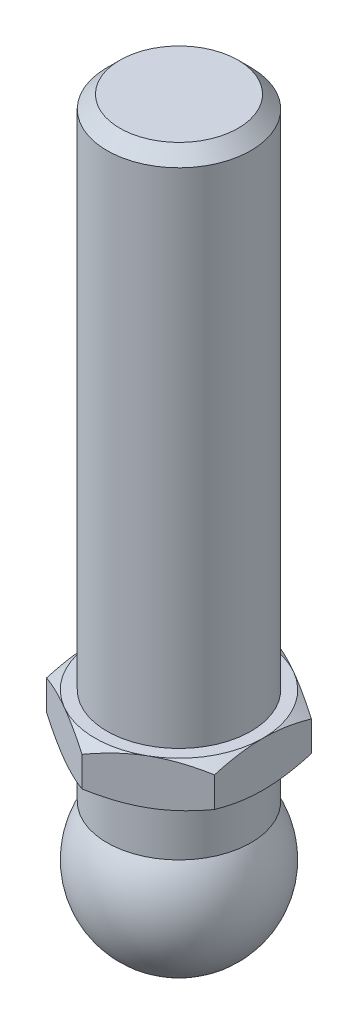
ISO-10303-21;
HEADER;
FILE_DESCRIPTION(('STEP AP214'),'2;1');
FILE_NAME('part.step','',(''),(''),'','','');
FILE_SCHEMA(('AUTOMOTIVE_DESIGN { 1 0 10303 214 1 1 1 1 }'));
ENDSEC;
DATA;
#1=APPLICATION_CONTEXT('core data for automotive mechanical design processes');
#2=APPLICATION_PROTOCOL_DEFINITION('international standard','automotive_design',2000,#1);
#3=PRODUCT_CONTEXT('',#1,'mechanical');
#4=PRODUCT('Part','Part','',(#3));
#5=PRODUCT_RELATED_PRODUCT_CATEGORY('part','',(#4));
#6=PRODUCT_DEFINITION_FORMATION('','',#4);
#7=PRODUCT_DEFINITION_CONTEXT('part definition',#1,'design');
#8=PRODUCT_DEFINITION('design','',#6,#7);
#9=PRODUCT_DEFINITION_SHAPE('','',#8);
#10=(LENGTH_UNIT() NAMED_UNIT(*) SI_UNIT(.MILLI.,.METRE.));
#11=(NAMED_UNIT(*) PLANE_ANGLE_UNIT() SI_UNIT($,.RADIAN.));
#12=(NAMED_UNIT(*) SI_UNIT($,.STERADIAN.) SOLID_ANGLE_UNIT());
#13=UNCERTAINTY_MEASURE_WITH_UNIT(LENGTH_MEASURE(1.E-05),#10,'distance_accuracy_value','');
#14=(GEOMETRIC_REPRESENTATION_CONTEXT(3) GLOBAL_UNCERTAINTY_ASSIGNED_CONTEXT((#13)) GLOBAL_UNIT_ASSIGNED_CONTEXT((#10,
#11,#12)) REPRESENTATION_CONTEXT('',''));
#15=CARTESIAN_POINT('',(0.,0.,0.));
#16=DIRECTION('',(0.,0.,1.));
#17=DIRECTION('',(1.,0.,0.));
#18=AXIS2_PLACEMENT_3D('',#15,#16,#17);
#19=CARTESIAN_POINT('',(0.,12.25,0.));
#20=DIRECTION('',(0.,-1.,0.));
#21=DIRECTION('',(0.,0.,-1.));
#22=AXIS2_PLACEMENT_3D('',#19,#20,#21);
#23=CONICAL_SURFACE('',#22,7.,1.0471975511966);
#24=CARTESIAN_POINT('',(-7.,8.18828268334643,12.1648696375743));
#25=CARTESIAN_POINT('',(-7.,8.33391573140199,11.8738003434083));
#26=CARTESIAN_POINT('',(-7.,8.47854589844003,11.5822239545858));
#27=CARTESIAN_POINT('',(-7.,8.76531569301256,10.997825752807));
#28=CARTESIAN_POINT('',(-7.,8.90745515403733,10.7050038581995));
#29=CARTESIAN_POINT('',(-7.,9.18902214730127,10.117331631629));
#30=CARTESIAN_POINT('',(-7.,9.32844364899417,9.8224784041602));
#31=CARTESIAN_POINT('',(-7.,9.60360604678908,9.23106328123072));
#32=CARTESIAN_POINT('',(-7.,9.73934701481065,8.93450141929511));
#33=CARTESIAN_POINT('',(-7.,10.0123110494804,8.32593520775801));
#34=CARTESIAN_POINT('',(-7.,10.1493254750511,8.0138369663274));
#35=CARTESIAN_POINT('',(-7.,10.4171383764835,7.38695797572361));
#36=CARTESIAN_POINT('',(-7.,10.5479365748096,7.07217710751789));
#37=CARTESIAN_POINT('',(-7.,10.8015530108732,6.43962449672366));
#38=CARTESIAN_POINT('',(-7.,10.924376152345,6.12185473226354));
#39=CARTESIAN_POINT('',(-7.,11.1599016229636,5.4826031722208));
#40=CARTESIAN_POINT('',(-7.,11.2726050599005,5.16112178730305));
#41=CARTESIAN_POINT('',(-7.,11.5099014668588,4.43821731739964));
#42=CARTESIAN_POINT('',(-7.,11.631118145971,4.03566892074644));
#43=CARTESIAN_POINT('',(-7.,11.8469740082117,3.22331060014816));
#44=CARTESIAN_POINT('',(-7.,11.9416155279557,2.81350131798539));
#45=CARTESIAN_POINT('',(-7.,12.0569999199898,2.1974256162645));
#46=CARTESIAN_POINT('',(-7.,12.0908518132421,1.99359214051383));
#47=CARTESIAN_POINT('',(-7.,12.1493191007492,1.58461613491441));
#48=CARTESIAN_POINT('',(-7.,12.1739358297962,1.37947379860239));
#49=CARTESIAN_POINT('',(-7.,12.2131968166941,0.968289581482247));
#50=CARTESIAN_POINT('',(-7.,12.2278439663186,0.762247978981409));
#51=CARTESIAN_POINT('',(-7.,12.2467021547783,0.349683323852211));
#52=CARTESIAN_POINT('',(-7.,12.2509132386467,0.143160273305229));
#53=CARTESIAN_POINT('',(-7.,12.2487493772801,-0.271082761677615));
#54=CARTESIAN_POINT('',(-7.,12.2423100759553,-0.47880240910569));
#55=CARTESIAN_POINT('',(-7.,12.2189433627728,-0.893645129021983));
#56=CARTESIAN_POINT('',(-7.,12.2020159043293,-1.10076819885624));
#57=CARTESIAN_POINT('',(-7.,12.1582124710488,-1.5140304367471));
#58=CARTESIAN_POINT('',(-7.,12.1313327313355,-1.72016920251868));
#59=CARTESIAN_POINT('',(-7.,12.0684180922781,-2.13103319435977));
#60=CARTESIAN_POINT('',(-7.,12.0323828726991,-2.33575837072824));
#61=CARTESIAN_POINT('',(-7.,11.9105686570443,-2.95437912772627));
#62=CARTESIAN_POINT('',(-7.,11.8118729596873,-3.36575077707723));
#63=CARTESIAN_POINT('',(-7.,11.5884533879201,-4.18138012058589));
#64=CARTESIAN_POINT('',(-7.,11.4637148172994,-4.58563365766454));
#65=CARTESIAN_POINT('',(-7.,11.2233248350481,-5.30320893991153));
#66=CARTESIAN_POINT('',(-7.,11.1112875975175,-5.6177595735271));
#67=CARTESIAN_POINT('',(-7.,10.8778514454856,-6.24325021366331));
#68=CARTESIAN_POINT('',(-7.,10.7564551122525,-6.55419118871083));
#69=CARTESIAN_POINT('',(-7.,10.5062070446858,-7.17328528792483));
#70=CARTESIAN_POINT('',(-7.,10.3773503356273,-7.48143638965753));
#71=CARTESIAN_POINT('',(-7.,10.1137823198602,-8.09523802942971));
#72=CARTESIAN_POINT('',(-7.,9.97907065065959,-8.40088841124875));
#73=CARTESIAN_POINT('',(-7.,9.71078407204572,-8.99716345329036));
#74=CARTESIAN_POINT('',(-7.,9.57740317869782,-9.2878756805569));
#75=CARTESIAN_POINT('',(-7.,9.30714715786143,-9.86766295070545));
#76=CARTESIAN_POINT('',(-7.,9.17027208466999,-10.1567380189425));
#77=CARTESIAN_POINT('',(-7.,8.89389786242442,-10.7329937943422));
#78=CARTESIAN_POINT('',(-7.,8.75440383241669,-11.0201769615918));
#79=CARTESIAN_POINT('',(-7.,8.47302286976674,-11.5933594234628));
#80=CARTESIAN_POINT('',(-7.,8.33113600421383,-11.879358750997));
#81=CARTESIAN_POINT('',(-7.,8.18828268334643,-12.1648696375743));
#82=B_SPLINE_CURVE_WITH_KNOTS('',3,(#24,#25,#26,#27,#28,#29,#30,#31,#32,#33,#34,#35,#36,#37,#38,
#39,#40,#41,#42,#43,#44,#45,#46,#47,#48,#49,#50,#51,#52,#53,#54,#55,#56,#57,#58,#59,#60,#61,#62,
#63,#64,#65,#66,#67,#68,#69,#70,#71,#72,#73,#74,#75,#76,#77,#78,#79,#80,#81),.UNSPECIFIED.,.F.,
.F.,(4,2,2,2,2,2,2,2,2,2,2,2,2,2,2,2,2,2,2,2,2,2,2,2,2,2,2,2,4),(0.,0.976413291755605,
1.95289161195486,2.93133423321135,3.90975772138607,4.93225217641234,5.95479223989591,
6.97669748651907,7.99849072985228,9.25906449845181,10.5195273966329,11.1392271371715,
11.7588372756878,12.3782676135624,12.9976952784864,13.6208795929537,14.2440666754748,
14.8674897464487,15.490934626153,16.7587972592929,18.027377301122,19.0289263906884,
20.0302002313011,21.0321496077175,22.0341611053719,22.9936838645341,23.9531917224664,
24.9109871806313,25.8687558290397),.UNSPECIFIED.);
#83=CARTESIAN_POINT('',(-7.,11.6247852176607,4.04145188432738));
#84=VERTEX_POINT('',#83);
#85=CARTESIAN_POINT('',(-7.,12.25,0.));
#86=VERTEX_POINT('',#85);
#87=EDGE_CURVE('E316',#84,#86,#82,.T.);
#88=ORIENTED_EDGE('',*,*,#87,.F.);
#89=CARTESIAN_POINT('',(0.0002,11.6247185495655,8.0830192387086));
#90=CARTESIAN_POINT('',(-0.153667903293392,11.6760001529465,7.99418356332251));
#91=CARTESIAN_POINT('',(-0.30810950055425,11.7249544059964,7.90501666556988));
#92=CARTESIAN_POINT('',(-0.618246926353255,11.8175672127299,7.72595873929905));
#93=CARTESIAN_POINT('',(-0.773943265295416,11.8612234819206,7.63606741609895));
#94=CARTESIAN_POINT('',(-1.24352516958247,11.9833884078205,7.36495417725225));
#95=CARTESIAN_POINT('',(-1.5592643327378,12.052874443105,7.18266208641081));
#96=CARTESIAN_POINT('',(-2.03176224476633,12.1343550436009,6.9098652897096));
#97=CARTESIAN_POINT('',(-2.18710922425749,12.1575665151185,6.82017566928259));
#98=CARTESIAN_POINT('',(-2.49850511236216,12.1964887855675,6.64039116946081));
#99=CARTESIAN_POINT('',(-2.65455395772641,12.2122002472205,6.55029632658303));
#100=CARTESIAN_POINT('',(-2.96692267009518,12.2357220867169,6.36995016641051));
#101=CARTESIAN_POINT('',(-3.12324202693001,12.2435414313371,6.27969914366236));
#102=CARTESIAN_POINT('',(-3.43601650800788,12.2511197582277,6.09911871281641));
#103=CARTESIAN_POINT('',(-3.59247162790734,12.250878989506,6.00878930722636));
#104=CARTESIAN_POINT('',(-4.02110687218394,12.2391402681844,5.76131663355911));
#105=CARTESIAN_POINT('',(-4.2931466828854,12.2194342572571,5.60425437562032));
#106=CARTESIAN_POINT('',(-4.8354194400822,12.1569465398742,5.29117305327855));
#107=CARTESIAN_POINT('',(-5.10565047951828,12.114143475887,5.13515508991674));
#108=CARTESIAN_POINT('',(-5.64901454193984,12.0071483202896,4.82144370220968));
#109=CARTESIAN_POINT('',(-5.92207900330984,11.9425029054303,4.66378986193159));
#110=CARTESIAN_POINT('',(-6.46413578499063,11.795783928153,4.35083323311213));
#111=CARTESIAN_POINT('',(-6.73313504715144,11.7137448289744,4.19552643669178));
#112=CARTESIAN_POINT('',(-7.0002,11.6247185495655,4.04133641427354));
#113=B_SPLINE_CURVE_WITH_KNOTS('',3,(#89,#90,#91,#92,#93,#94,#95,#96,#97,#98,#99,#100,#101,#102,
#103,#104,#105,#106,#107,#108,#109,#110,#111,#112),.UNSPECIFIED.,.F.,.F.,(4,2,2,2,2,2,2,2,2,2,2,
4),(0.,0.554727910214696,1.10969417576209,2.2219327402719,2.76443041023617,3.30688013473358,
3.8487128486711,4.3905288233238,5.33376515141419,6.27787517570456,7.2429241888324,
8.20607866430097),.UNSPECIFIED.);
#114=CARTESIAN_POINT('',(-3.5,12.25,6.06217782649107));
#115=VERTEX_POINT('',#114);
#116=EDGE_CURVE('E138',#115,#84,#113,.T.);
#117=ORIENTED_EDGE('',*,*,#116,.F.);
#118=CARTESIAN_POINT('',(0.,12.25,0.));
#119=DIRECTION('',(0.,-1.,0.));
#120=DIRECTION('',(0.,0.,-1.));
#121=AXIS2_PLACEMENT_3D('',#118,#119,#120);
#122=CIRCLE('',#121,7.);
#123=EDGE_CURVE('E286',#115,#86,#122,.T.);
#124=ORIENTED_EDGE('',*,*,#123,.T.);
#125=EDGE_LOOP('',(#88,#117,#124));
#126=FACE_BOUND('',#125,.T.);
#127=ADVANCED_FACE('F17',(#126),#23,.T.);
#128=CARTESIAN_POINT('',(-7.,11.6247852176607,-4.04145188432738));
#129=VERTEX_POINT('',#128);
#130=EDGE_CURVE('E196',#86,#129,#82,.T.);
#131=ORIENTED_EDGE('',*,*,#130,.F.);
#132=CARTESIAN_POINT('',(-3.5,12.25,-6.06217782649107));
#133=VERTEX_POINT('',#132);
#134=EDGE_CURVE('E198',#86,#133,#122,.T.);
#135=ORIENTED_EDGE('',*,*,#134,.T.);
#136=CARTESIAN_POINT('',(-7.0002,11.6247185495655,-4.04133641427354));
#137=CARTESIAN_POINT('',(-6.84633209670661,11.6760001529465,-4.13017208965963));
#138=CARTESIAN_POINT('',(-6.69189049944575,11.7249544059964,-4.21933898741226));
#139=CARTESIAN_POINT('',(-6.38175307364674,11.8175672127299,-4.39839691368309));
#140=CARTESIAN_POINT('',(-6.22605673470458,11.8612234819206,-4.48828823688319));
#141=CARTESIAN_POINT('',(-5.75647483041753,11.9833884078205,-4.75940147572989));
#142=CARTESIAN_POINT('',(-5.4407356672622,12.052874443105,-4.94169356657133));
#143=CARTESIAN_POINT('',(-4.96823775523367,12.1343550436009,-5.21449036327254));
#144=CARTESIAN_POINT('',(-4.81289077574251,12.1575665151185,-5.30417998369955));
#145=CARTESIAN_POINT('',(-4.50149488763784,12.1964887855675,-5.48396448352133));
#146=CARTESIAN_POINT('',(-4.34544604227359,12.2122002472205,-5.57405932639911));
#147=CARTESIAN_POINT('',(-4.03307732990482,12.2357220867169,-5.75440548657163));
#148=CARTESIAN_POINT('',(-3.87675797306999,12.2435414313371,-5.84465650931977));
#149=CARTESIAN_POINT('',(-3.56398349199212,12.2511197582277,-6.02523694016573));
#150=CARTESIAN_POINT('',(-3.40752837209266,12.250878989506,-6.11556634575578));
#151=CARTESIAN_POINT('',(-2.97889312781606,12.2391402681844,-6.36303901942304));
#152=CARTESIAN_POINT('',(-2.7068533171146,12.2194342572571,-6.52010127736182));
#153=CARTESIAN_POINT('',(-2.1645805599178,12.1569465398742,-6.83318259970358));
#154=CARTESIAN_POINT('',(-1.89434952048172,12.114143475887,-6.9892005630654));
#155=CARTESIAN_POINT('',(-1.35098545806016,12.0071483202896,-7.30291195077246));
#156=CARTESIAN_POINT('',(-1.07792099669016,11.9425029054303,-7.46056579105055));
#157=CARTESIAN_POINT('',(-0.53586421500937,11.795783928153,-7.77352241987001));
#158=CARTESIAN_POINT('',(-0.266864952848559,11.7137448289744,-7.92882921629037));
#159=CARTESIAN_POINT('',(0.000200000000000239,11.6247185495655,-8.0830192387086));
#160=B_SPLINE_CURVE_WITH_KNOTS('',3,(#136,#137,#138,#139,#140,#141,#142,#143,#144,#145,#146,
#147,#148,#149,#150,#151,#152,#153,#154,#155,#156,#157,#158,#159),.UNSPECIFIED.,.F.,.F.,(4,2,2,
2,2,2,2,2,2,2,2,4),(0.,0.554727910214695,1.10969417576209,2.2219327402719,2.76443041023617,
3.30688013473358,3.8487128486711,4.39052882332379,5.33376515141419,6.27787517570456,
7.2429241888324,8.20607866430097),.UNSPECIFIED.);
#161=EDGE_CURVE('E186',#129,#133,#160,.T.);
#162=ORIENTED_EDGE('',*,*,#161,.F.);
#163=EDGE_LOOP('',(#131,#135,#162));
#164=FACE_BOUND('',#163,.T.);
#165=ADVANCED_FACE('F195',(#164),#23,.T.);
#166=CARTESIAN_POINT('',(0.,11.6247852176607,-8.08290376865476));
#167=VERTEX_POINT('',#166);
#168=EDGE_CURVE('E200',#133,#167,#160,.T.);
#169=ORIENTED_EDGE('',*,*,#168,.F.);
#170=CARTESIAN_POINT('',(3.5,12.25,-6.06217782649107));
#171=VERTEX_POINT('',#170);
#172=EDGE_CURVE('E296',#133,#171,#122,.T.);
#173=ORIENTED_EDGE('',*,*,#172,.T.);
#174=CARTESIAN_POINT('',(-0.0002,11.6247185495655,-8.0830192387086));
#175=CARTESIAN_POINT('',(0.153667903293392,11.6760001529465,-7.99418356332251));
#176=CARTESIAN_POINT('',(0.30810950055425,11.7249544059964,-7.90501666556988));
#177=CARTESIAN_POINT('',(0.618246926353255,11.8175672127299,-7.72595873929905));
#178=CARTESIAN_POINT('',(0.773943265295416,11.8612234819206,-7.63606741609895));
#179=CARTESIAN_POINT('',(1.24352516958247,11.9833884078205,-7.36495417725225));
#180=CARTESIAN_POINT('',(1.5592643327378,12.052874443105,-7.18266208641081));
#181=CARTESIAN_POINT('',(2.03176224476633,12.1343550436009,-6.9098652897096));
#182=CARTESIAN_POINT('',(2.18710922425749,12.1575665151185,-6.82017566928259));
#183=CARTESIAN_POINT('',(2.49850511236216,12.1964887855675,-6.64039116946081));
#184=CARTESIAN_POINT('',(2.65455395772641,12.2122002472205,-6.55029632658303));
#185=CARTESIAN_POINT('',(2.96692267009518,12.2357220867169,-6.36995016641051));
#186=CARTESIAN_POINT('',(3.12324202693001,12.2435414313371,-6.27969914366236));
#187=CARTESIAN_POINT('',(3.43601650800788,12.2511197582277,-6.09911871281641));
#188=CARTESIAN_POINT('',(3.59247162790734,12.250878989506,-6.00878930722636));
#189=CARTESIAN_POINT('',(4.02110687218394,12.2391402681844,-5.76131663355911));
#190=CARTESIAN_POINT('',(4.2931466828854,12.2194342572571,-5.60425437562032));
#191=CARTESIAN_POINT('',(4.8354194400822,12.1569465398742,-5.29117305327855));
#192=CARTESIAN_POINT('',(5.10565047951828,12.114143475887,-5.13515508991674));
#193=CARTESIAN_POINT('',(5.64901454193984,12.0071483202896,-4.82144370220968));
#194=CARTESIAN_POINT('',(5.92207900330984,11.9425029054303,-4.66378986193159));
#195=CARTESIAN_POINT('',(6.46413578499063,11.795783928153,-4.35083323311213));
#196=CARTESIAN_POINT('',(6.73313504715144,11.7137448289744,-4.19552643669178));
#197=CARTESIAN_POINT('',(7.0002,11.6247185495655,-4.04133641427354));
#198=B_SPLINE_CURVE_WITH_KNOTS('',3,(#174,#175,#176,#177,#178,#179,#180,#181,#182,#183,#184,
#185,#186,#187,#188,#189,#190,#191,#192,#193,#194,#195,#196,#197),.UNSPECIFIED.,.F.,.F.,(4,2,2,
2,2,2,2,2,2,2,2,4),(0.,0.554727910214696,1.10969417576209,2.2219327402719,2.76443041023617,
3.30688013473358,3.8487128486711,4.3905288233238,5.33376515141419,6.27787517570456,
7.2429241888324,8.20607866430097),.UNSPECIFIED.);
#199=EDGE_CURVE('E246',#167,#171,#198,.T.);
#200=ORIENTED_EDGE('',*,*,#199,.F.);
#201=EDGE_LOOP('',(#169,#173,#200));
#202=FACE_BOUND('',#201,.T.);
#203=ADVANCED_FACE('F349',(#202),#23,.T.);
#204=CARTESIAN_POINT('',(7.,11.6247852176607,-4.04145188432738));
#205=VERTEX_POINT('',#204);
#206=EDGE_CURVE('E241',#171,#205,#198,.T.);
#207=ORIENTED_EDGE('',*,*,#206,.F.);
#208=CARTESIAN_POINT('',(7.,12.25,0.));
#209=VERTEX_POINT('',#208);
#210=EDGE_CURVE('E291',#171,#209,#122,.T.);
#211=ORIENTED_EDGE('',*,*,#210,.T.);
#212=CARTESIAN_POINT('',(7.,8.18828268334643,-12.1648696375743));
#213=CARTESIAN_POINT('',(7.,8.33391573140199,-11.8738003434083));
#214=CARTESIAN_POINT('',(7.,8.47854589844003,-11.5822239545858));
#215=CARTESIAN_POINT('',(7.,8.76531569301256,-10.997825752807));
#216=CARTESIAN_POINT('',(7.,8.90745515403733,-10.7050038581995));
#217=CARTESIAN_POINT('',(7.,9.18902214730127,-10.117331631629));
#218=CARTESIAN_POINT('',(7.,9.32844364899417,-9.8224784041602));
#219=CARTESIAN_POINT('',(7.,9.60360604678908,-9.23106328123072));
#220=CARTESIAN_POINT('',(7.,9.73934701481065,-8.93450141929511));
#221=CARTESIAN_POINT('',(7.,10.0123110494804,-8.32593520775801));
#222=CARTESIAN_POINT('',(7.,10.1493254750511,-8.0138369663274));
#223=CARTESIAN_POINT('',(7.,10.4171383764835,-7.38695797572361));
#224=CARTESIAN_POINT('',(7.,10.5479365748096,-7.07217710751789));
#225=CARTESIAN_POINT('',(7.,10.8015530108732,-6.43962449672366));
#226=CARTESIAN_POINT('',(7.,10.924376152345,-6.12185473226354));
#227=CARTESIAN_POINT('',(7.,11.1599016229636,-5.4826031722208));
#228=CARTESIAN_POINT('',(7.,11.2726050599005,-5.16112178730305));
#229=CARTESIAN_POINT('',(7.,11.5099014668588,-4.43821731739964));
#230=CARTESIAN_POINT('',(7.,11.631118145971,-4.03566892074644));
#231=CARTESIAN_POINT('',(7.,11.8469740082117,-3.22331060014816));
#232=CARTESIAN_POINT('',(7.,11.9416155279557,-2.81350131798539));
#233=CARTESIAN_POINT('',(7.,12.0569999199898,-2.1974256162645));
#234=CARTESIAN_POINT('',(7.,12.0908518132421,-1.99359214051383));
#235=CARTESIAN_POINT('',(7.,12.1493191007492,-1.58461613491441));
#236=CARTESIAN_POINT('',(7.,12.1739358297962,-1.37947379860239));
#237=CARTESIAN_POINT('',(7.,12.2131968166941,-0.968289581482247));
#238=CARTESIAN_POINT('',(7.,12.2278439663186,-0.762247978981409));
#239=CARTESIAN_POINT('',(7.,12.2467021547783,-0.349683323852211));
#240=CARTESIAN_POINT('',(7.,12.2509132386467,-0.143160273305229));
#241=CARTESIAN_POINT('',(7.,12.2487493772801,0.271082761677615));
#242=CARTESIAN_POINT('',(7.,12.2423100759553,0.47880240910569));
#243=CARTESIAN_POINT('',(7.,12.2189433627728,0.893645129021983));
#244=CARTESIAN_POINT('',(7.,12.2020159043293,1.10076819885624));
#245=CARTESIAN_POINT('',(7.,12.1582124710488,1.5140304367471));
#246=CARTESIAN_POINT('',(7.,12.1313327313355,1.72016920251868));
#247=CARTESIAN_POINT('',(7.,12.0684180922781,2.13103319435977));
#248=CARTESIAN_POINT('',(7.,12.0323828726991,2.33575837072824));
#249=CARTESIAN_POINT('',(7.,11.9105686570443,2.95437912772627));
#250=CARTESIAN_POINT('',(7.,11.8118729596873,3.36575077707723));
#251=CARTESIAN_POINT('',(7.,11.5884533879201,4.18138012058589));
#252=CARTESIAN_POINT('',(7.,11.4637148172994,4.58563365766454));
#253=CARTESIAN_POINT('',(7.,11.2233248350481,5.30320893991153));
#254=CARTESIAN_POINT('',(7.,11.1112875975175,5.6177595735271));
#255=CARTESIAN_POINT('',(7.,10.8778514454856,6.24325021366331));
#256=CARTESIAN_POINT('',(7.,10.7564551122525,6.55419118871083));
#257=CARTESIAN_POINT('',(7.,10.5062070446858,7.17328528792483));
#258=CARTESIAN_POINT('',(7.,10.3773503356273,7.48143638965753));
#259=CARTESIAN_POINT('',(7.,10.1137823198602,8.09523802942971));
#260=CARTESIAN_POINT('',(7.,9.97907065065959,8.40088841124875));
#261=CARTESIAN_POINT('',(7.,9.71078407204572,8.99716345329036));
#262=CARTESIAN_POINT('',(7.,9.57740317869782,9.2878756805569));
#263=CARTESIAN_POINT('',(7.,9.30714715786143,9.86766295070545));
#264=CARTESIAN_POINT('',(7.,9.17027208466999,10.1567380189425));
#265=CARTESIAN_POINT('',(7.,8.89389786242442,10.7329937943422));
#266=CARTESIAN_POINT('',(7.,8.75440383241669,11.0201769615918));
#267=CARTESIAN_POINT('',(7.,8.47302286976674,11.5933594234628));
#268=CARTESIAN_POINT('',(7.,8.33113600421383,11.879358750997));
#269=CARTESIAN_POINT('',(7.,8.18828268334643,12.1648696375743));
#270=B_SPLINE_CURVE_WITH_KNOTS('',3,(#212,#213,#214,#215,#216,#217,#218,#219,#220,#221,#222,
#223,#224,#225,#226,#227,#228,#229,#230,#231,#232,#233,#234,#235,#236,#237,#238,#239,#240,#241,
#242,#243,#244,#245,#246,#247,#248,#249,#250,#251,#252,#253,#254,#255,#256,#257,#258,#259,#260,
#261,#262,#263,#264,#265,#266,#267,#268,#269),.UNSPECIFIED.,.F.,.F.,(4,2,2,2,2,2,2,2,2,2,2,2,2,
2,2,2,2,2,2,2,2,2,2,2,2,2,2,2,4),(0.,0.976413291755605,1.95289161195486,2.93133423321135,
3.90975772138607,4.93225217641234,5.95479223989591,6.97669748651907,7.99849072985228,
9.25906449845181,10.5195273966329,11.1392271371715,11.7588372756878,12.3782676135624,
12.9976952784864,13.6208795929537,14.2440666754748,14.8674897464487,15.490934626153,
16.7587972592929,18.027377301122,19.0289263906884,20.0302002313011,21.0321496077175,
22.0341611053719,22.9936838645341,23.9531917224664,24.9109871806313,25.8687558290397),.UNSPECIFIED.);
#271=EDGE_CURVE('E252',#205,#209,#270,.T.);
#272=ORIENTED_EDGE('',*,*,#271,.F.);
#273=EDGE_LOOP('',(#207,#211,#272));
#274=FACE_BOUND('',#273,.T.);
#275=ADVANCED_FACE('F359',(#274),#23,.T.);
#276=CARTESIAN_POINT('',(7.,11.6247852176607,4.04145188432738));
#277=VERTEX_POINT('',#276);
#278=EDGE_CURVE('E254',#209,#277,#270,.T.);
#279=ORIENTED_EDGE('',*,*,#278,.F.);
#280=CARTESIAN_POINT('',(3.5,12.25,6.06217782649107));
#281=VERTEX_POINT('',#280);
#282=EDGE_CURVE('E284',#209,#281,#122,.T.);
#283=ORIENTED_EDGE('',*,*,#282,.T.);
#284=CARTESIAN_POINT('',(7.0002,11.6247185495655,4.04133641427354));
#285=CARTESIAN_POINT('',(6.84633209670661,11.6760001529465,4.13017208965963));
#286=CARTESIAN_POINT('',(6.69189049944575,11.7249544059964,4.21933898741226));
#287=CARTESIAN_POINT('',(6.38175307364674,11.8175672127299,4.39839691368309));
#288=CARTESIAN_POINT('',(6.22605673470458,11.8612234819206,4.48828823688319));
#289=CARTESIAN_POINT('',(5.75647483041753,11.9833884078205,4.75940147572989));
#290=CARTESIAN_POINT('',(5.4407356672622,12.052874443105,4.94169356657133));
#291=CARTESIAN_POINT('',(4.96823775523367,12.1343550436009,5.21449036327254));
#292=CARTESIAN_POINT('',(4.81289077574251,12.1575665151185,5.30417998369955));
#293=CARTESIAN_POINT('',(4.50149488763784,12.1964887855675,5.48396448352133));
#294=CARTESIAN_POINT('',(4.34544604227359,12.2122002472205,5.57405932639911));
#295=CARTESIAN_POINT('',(4.03307732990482,12.2357220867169,5.75440548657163));
#296=CARTESIAN_POINT('',(3.87675797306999,12.2435414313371,5.84465650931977));
#297=CARTESIAN_POINT('',(3.56398349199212,12.2511197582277,6.02523694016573));
#298=CARTESIAN_POINT('',(3.40752837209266,12.250878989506,6.11556634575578));
#299=CARTESIAN_POINT('',(2.97889312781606,12.2391402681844,6.36303901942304));
#300=CARTESIAN_POINT('',(2.7068533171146,12.2194342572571,6.52010127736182));
#301=CARTESIAN_POINT('',(2.1645805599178,12.1569465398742,6.83318259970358));
#302=CARTESIAN_POINT('',(1.89434952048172,12.114143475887,6.9892005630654));
#303=CARTESIAN_POINT('',(1.35098545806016,12.0071483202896,7.30291195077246));
#304=CARTESIAN_POINT('',(1.07792099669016,11.9425029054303,7.46056579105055));
#305=CARTESIAN_POINT('',(0.53586421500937,11.795783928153,7.77352241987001));
#306=CARTESIAN_POINT('',(0.266864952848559,11.7137448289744,7.92882921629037));
#307=CARTESIAN_POINT('',(-0.000200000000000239,11.6247185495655,8.0830192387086));
#308=B_SPLINE_CURVE_WITH_KNOTS('',3,(#284,#285,#286,#287,#288,#289,#290,#291,#292,#293,#294,
#295,#296,#297,#298,#299,#300,#301,#302,#303,#304,#305,#306,#307),.UNSPECIFIED.,.F.,.F.,(4,2,2,
2,2,2,2,2,2,2,2,4),(0.,0.554727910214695,1.10969417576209,2.2219327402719,2.76443041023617,
3.30688013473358,3.8487128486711,4.39052882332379,5.33376515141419,6.27787517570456,
7.2429241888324,8.20607866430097),.UNSPECIFIED.);
#309=EDGE_CURVE('E129',#277,#281,#308,.T.);
#310=ORIENTED_EDGE('',*,*,#309,.F.);
#311=EDGE_LOOP('',(#279,#283,#310));
#312=FACE_BOUND('',#311,.T.);
#313=ADVANCED_FACE('F288',(#312),#23,.T.);
#314=CARTESIAN_POINT('',(0.,11.6247852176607,8.08290376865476));
#315=VERTEX_POINT('',#314);
#316=EDGE_CURVE('E119',#281,#315,#308,.T.);
#317=ORIENTED_EDGE('',*,*,#316,.F.);
#318=EDGE_CURVE('E277',#281,#115,#122,.T.);
#319=ORIENTED_EDGE('',*,*,#318,.T.);
#320=EDGE_CURVE('E32',#315,#115,#113,.T.);
#321=ORIENTED_EDGE('',*,*,#320,.F.);
#322=EDGE_LOOP('',(#317,#319,#321));
#323=FACE_BOUND('',#322,.T.);
#324=ADVANCED_FACE('F276',(#323),#23,.T.);
#325=CARTESIAN_POINT('',(0.,55.25,0.));
#326=DIRECTION('',(0.,-1.,0.));
#327=DIRECTION('',(0.,0.,-1.));
#328=AXIS2_PLACEMENT_3D('',#325,#326,#327);
#329=PLANE('',#328);
#330=CARTESIAN_POINT('',(0.,55.25,0.));
#331=DIRECTION('',(0.,-1.,0.));
#332=DIRECTION('',(0.,0.,-1.));
#333=AXIS2_PLACEMENT_3D('',#330,#331,#332);
#334=CIRCLE('',#333,4.9265);
#335=CARTESIAN_POINT('',(0.,55.25,-4.9265));
#336=VERTEX_POINT('',#335);
#337=EDGE_CURVE('E25',#336,#336,#334,.T.);
#338=ORIENTED_EDGE('',*,*,#337,.F.);
#339=EDGE_LOOP('',(#338));
#340=FACE_BOUND('',#339,.T.);
#341=ADVANCED_FACE('F19',(#340),#329,.F.);
#342=CARTESIAN_POINT('',(0.,55.25,0.));
#343=DIRECTION('',(0.,-1.,0.));
#344=DIRECTION('',(0.,0.,-1.));
#345=AXIS2_PLACEMENT_3D('',#342,#343,#344);
#346=CONICAL_SURFACE('',#345,4.9265,0.785398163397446);
#347=CARTESIAN_POINT('',(0.,54.1765,0.));
#348=DIRECTION('',(0.,-1.,0.));
#349=DIRECTION('',(0.,0.,-1.));
#350=AXIS2_PLACEMENT_3D('',#347,#348,#349);
#351=CIRCLE('',#350,6.);
#352=CARTESIAN_POINT('',(0.,54.1765,-6.));
#353=VERTEX_POINT('',#352);
#354=EDGE_CURVE('E293',#353,#353,#351,.T.);
#355=ORIENTED_EDGE('',*,*,#354,.F.);
#356=EDGE_LOOP('',(#355));
#357=FACE_BOUND('',#356,.T.);
#358=ORIENTED_EDGE('',*,*,#337,.T.);
#359=EDGE_LOOP('',(#358));
#360=FACE_BOUND('',#359,.T.);
#361=ADVANCED_FACE('F357',(#357,#360),#346,.T.);
#362=CARTESIAN_POINT('',(0.,-7.,0.));
#363=DIRECTION('',(0.,-1.,0.));
#364=DIRECTION('',(0.,0.,-1.));
#365=AXIS2_PLACEMENT_3D('',#362,#363,#364);
#366=CYLINDRICAL_SURFACE('',#365,6.);
#367=CARTESIAN_POINT('',(0.,12.25,0.));
#368=DIRECTION('',(0.,-1.,0.));
#369=DIRECTION('',(0.,0.,-1.));
#370=AXIS2_PLACEMENT_3D('',#367,#368,#369);
#371=CIRCLE('',#370,6.);
#372=CARTESIAN_POINT('',(0.,12.25,-6.));
#373=VERTEX_POINT('',#372);
#374=EDGE_CURVE('E290',#373,#373,#371,.T.);
#375=ORIENTED_EDGE('',*,*,#374,.F.);
#376=EDGE_LOOP('',(#375));
#377=FACE_BOUND('',#376,.T.);
#378=ORIENTED_EDGE('',*,*,#354,.T.);
#379=EDGE_LOOP('',(#378));
#380=FACE_BOUND('',#379,.T.);
#381=ADVANCED_FACE('F442',(#377,#380),#366,.T.);
#382=CARTESIAN_POINT('',(6.,12.25,0.));
#383=DIRECTION('',(0.,-1.,0.));
#384=DIRECTION('',(0.,0.,-1.));
#385=AXIS2_PLACEMENT_3D('',#382,#383,#384);
#386=PLANE('',#385);
#387=ORIENTED_EDGE('',*,*,#282,.F.);
#388=ORIENTED_EDGE('',*,*,#210,.F.);
#389=ORIENTED_EDGE('',*,*,#172,.F.);
#390=ORIENTED_EDGE('',*,*,#134,.F.);
#391=ORIENTED_EDGE('',*,*,#123,.F.);
#392=ORIENTED_EDGE('',*,*,#318,.F.);
#393=EDGE_LOOP('',(#387,#388,#389,#390,#391,#392));
#394=FACE_BOUND('',#393,.T.);
#395=ORIENTED_EDGE('',*,*,#374,.T.);
#396=EDGE_LOOP('',(#395));
#397=FACE_BOUND('',#396,.T.);
#398=ADVANCED_FACE('F281',(#394,#397),#386,.F.);
#399=CARTESIAN_POINT('',(-7.,8.5,-4.04145188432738));
#400=DIRECTION('',(-1.,0.,0.));
#401=DIRECTION('',(0.,0.,1.));
#402=AXIS2_PLACEMENT_3D('',#399,#400,#401);
#403=PLANE('',#402);
#404=ORIENTED_EDGE('',*,*,#87,.T.);
#405=ORIENTED_EDGE('',*,*,#130,.T.);
#406=DIRECTION('',(0.,1.,0.));
#407=VECTOR('',#406,1.);
#408=CARTESIAN_POINT('',(-7.,8.5,-4.04145188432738));
#409=LINE('',#408,#407);
#410=CARTESIAN_POINT('',(-7.,9.12521478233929,-4.04145188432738));
#411=VERTEX_POINT('',#410);
#412=EDGE_CURVE('E112',#411,#129,#409,.T.);
#413=ORIENTED_EDGE('',*,*,#412,.F.);
#414=CARTESIAN_POINT('',(-7.,12.5617173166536,-12.1648696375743));
#415=CARTESIAN_POINT('',(-7.,12.416084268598,-11.8738003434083));
#416=CARTESIAN_POINT('',(-7.,12.27145410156,-11.5822239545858));
#417=CARTESIAN_POINT('',(-7.,11.9846843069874,-10.997825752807));
#418=CARTESIAN_POINT('',(-7.,11.8425448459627,-10.7050038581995));
#419=CARTESIAN_POINT('',(-7.,11.5609778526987,-10.1173316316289));
#420=CARTESIAN_POINT('',(-7.,11.4215563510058,-9.82247840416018));
#421=CARTESIAN_POINT('',(-7.,11.1463939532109,-9.23106328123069));
#422=CARTESIAN_POINT('',(-7.,11.0106529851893,-8.93450141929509));
#423=CARTESIAN_POINT('',(-7.,10.7376889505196,-8.32593520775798));
#424=CARTESIAN_POINT('',(-7.,10.6006745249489,-8.01383696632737));
#425=CARTESIAN_POINT('',(-7.,10.3328616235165,-7.38695797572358));
#426=CARTESIAN_POINT('',(-7.,10.2020634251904,-7.07217710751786));
#427=CARTESIAN_POINT('',(-7.,9.94844698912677,-6.43962449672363));
#428=CARTESIAN_POINT('',(-7.,9.825623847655,-6.12185473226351));
#429=CARTESIAN_POINT('',(-7.,9.59009837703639,-5.48260317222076));
#430=CARTESIAN_POINT('',(-7.,9.47739494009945,-5.16112178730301));
#431=CARTESIAN_POINT('',(-7.,9.24009853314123,-4.4382173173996));
#432=CARTESIAN_POINT('',(-7.,9.11888185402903,-4.03566892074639));
#433=CARTESIAN_POINT('',(-7.,8.90302599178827,-3.22331060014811));
#434=CARTESIAN_POINT('',(-7.,8.80838447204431,-2.81350131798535));
#435=CARTESIAN_POINT('',(-7.,8.69300008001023,-2.19742561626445));
#436=CARTESIAN_POINT('',(-7.,8.65914818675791,-1.99359214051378));
#437=CARTESIAN_POINT('',(-7.,8.60068089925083,-1.58461613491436));
#438=CARTESIAN_POINT('',(-7.,8.5760641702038,-1.37947379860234));
#439=CARTESIAN_POINT('',(-7.,8.53680318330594,-0.968289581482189));
#440=CARTESIAN_POINT('',(-7.,8.52215603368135,-0.76224797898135));
#441=CARTESIAN_POINT('',(-7.,8.50329784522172,-0.349683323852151));
#442=CARTESIAN_POINT('',(-7.,8.49908676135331,-0.143160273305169));
#443=CARTESIAN_POINT('',(-7.,8.50125062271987,0.271082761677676));
#444=CARTESIAN_POINT('',(-7.,8.50768992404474,0.478802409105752));
#445=CARTESIAN_POINT('',(-7.,8.53105663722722,0.893645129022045));
#446=CARTESIAN_POINT('',(-7.,8.54798409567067,1.1007681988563));
#447=CARTESIAN_POINT('',(-7.,8.59178752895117,1.51403043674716));
#448=CARTESIAN_POINT('',(-7.,8.61866726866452,1.72016920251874));
#449=CARTESIAN_POINT('',(-7.,8.68158190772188,2.13103319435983));
#450=CARTESIAN_POINT('',(-7.,8.71761712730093,2.33575837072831));
#451=CARTESIAN_POINT('',(-7.,8.83943134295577,2.95437912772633));
#452=CARTESIAN_POINT('',(-7.,8.93812704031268,3.3657507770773));
#453=CARTESIAN_POINT('',(-7.,9.16154661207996,4.18138012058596));
#454=CARTESIAN_POINT('',(-7.,9.28628518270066,4.58563365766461));
#455=CARTESIAN_POINT('',(-7.,9.52667516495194,5.30320893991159));
#456=CARTESIAN_POINT('',(-7.,9.63871240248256,5.61775957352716));
#457=CARTESIAN_POINT('',(-7.,9.87214855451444,6.24325021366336));
#458=CARTESIAN_POINT('',(-7.,9.99354488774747,6.55419118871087));
#459=CARTESIAN_POINT('',(-7.,10.2437929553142,7.17328528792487));
#460=CARTESIAN_POINT('',(-7.,10.3726496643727,7.48143638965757));
#461=CARTESIAN_POINT('',(-7.,10.6362176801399,8.09523802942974));
#462=CARTESIAN_POINT('',(-7.,10.7709293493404,8.40088841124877));
#463=CARTESIAN_POINT('',(-7.,11.0392159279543,8.99716345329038));
#464=CARTESIAN_POINT('',(-7.,11.1725968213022,9.28787568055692));
#465=CARTESIAN_POINT('',(-7.,11.4428528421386,9.86766295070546));
#466=CARTESIAN_POINT('',(-7.,11.57972791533,10.1567380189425));
#467=CARTESIAN_POINT('',(-7.,11.8561021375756,10.7329937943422));
#468=CARTESIAN_POINT('',(-7.,11.9955961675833,11.0201769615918));
#469=CARTESIAN_POINT('',(-7.,12.2769771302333,11.5933594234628));
#470=CARTESIAN_POINT('',(-7.,12.4188639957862,11.879358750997));
#471=CARTESIAN_POINT('',(-7.,12.5617173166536,12.1648696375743));
#472=B_SPLINE_CURVE_WITH_KNOTS('',3,(#414,#415,#416,#417,#418,#419,#420,#421,#422,#423,#424,
#425,#426,#427,#428,#429,#430,#431,#432,#433,#434,#435,#436,#437,#438,#439,#440,#441,#442,#443,
#444,#445,#446,#447,#448,#449,#450,#451,#452,#453,#454,#455,#456,#457,#458,#459,#460,#461,#462,
#463,#464,#465,#466,#467,#468,#469,#470,#471),.UNSPECIFIED.,.F.,.F.,(4,2,2,2,2,2,2,2,2,2,2,2,2,
2,2,2,2,2,2,2,2,2,2,2,2,2,2,2,4),(0.,0.976413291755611,1.95289161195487,2.93133423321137,
3.90975772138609,4.93225217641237,5.95479223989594,6.97669748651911,7.99849072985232,
9.25906449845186,10.5195273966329,11.1392271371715,11.7588372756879,12.3782676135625,
12.9976952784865,13.6208795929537,14.2440666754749,14.8674897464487,15.490934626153,
16.758797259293,18.0273773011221,19.0289263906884,20.0302002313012,21.0321496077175,
22.0341611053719,22.9936838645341,23.9531917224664,24.9109871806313,25.8687558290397),.UNSPECIFIED.);
#473=CARTESIAN_POINT('',(-7.,8.5,0.));
#474=VERTEX_POINT('',#473);
#475=EDGE_CURVE('E202',#411,#474,#472,.T.);
#476=ORIENTED_EDGE('',*,*,#475,.T.);
#477=CARTESIAN_POINT('',(-7.,9.12521478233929,4.04145188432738));
#478=VERTEX_POINT('',#477);
#479=EDGE_CURVE('E199',#474,#478,#472,.T.);
#480=ORIENTED_EDGE('',*,*,#479,.T.);
#481=DIRECTION('',(0.,1.,0.));
#482=VECTOR('',#481,1.);
#483=CARTESIAN_POINT('',(-7.,8.5,4.04145188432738));
#484=LINE('',#483,#482);
#485=EDGE_CURVE('E121',#478,#84,#484,.T.);
#486=ORIENTED_EDGE('',*,*,#485,.T.);
#487=EDGE_LOOP('',(#404,#405,#413,#476,#480,#486));
#488=FACE_BOUND('',#487,.T.);
#489=ADVANCED_FACE('F227',(#488),#403,.T.);
#490=CARTESIAN_POINT('',(0.,8.5,-8.08290376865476));
#491=DIRECTION('',(-0.5,0.,-0.866025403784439));
#492=DIRECTION('',(-0.866025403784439,0.,0.5));
#493=AXIS2_PLACEMENT_3D('',#490,#491,#492);
#494=PLANE('',#493);
#495=ORIENTED_EDGE('',*,*,#161,.T.);
#496=ORIENTED_EDGE('',*,*,#168,.T.);
#497=DIRECTION('',(0.,1.,0.));
#498=VECTOR('',#497,1.);
#499=CARTESIAN_POINT('',(0.,8.5,-8.08290376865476));
#500=LINE('',#499,#498);
#501=CARTESIAN_POINT('',(0.,9.12521478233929,-8.08290376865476));
#502=VERTEX_POINT('',#501);
#503=EDGE_CURVE('E178',#502,#167,#500,.T.);
#504=ORIENTED_EDGE('',*,*,#503,.F.);
#505=CARTESIAN_POINT('',(0.0002,9.1252814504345,-8.0830192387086));
#506=CARTESIAN_POINT('',(-0.153667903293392,9.07399984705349,-7.99418356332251));
#507=CARTESIAN_POINT('',(-0.308109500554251,9.02504559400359,-7.90501666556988));
#508=CARTESIAN_POINT('',(-0.618246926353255,8.93243278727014,-7.72595873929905));
#509=CARTESIAN_POINT('',(-0.773943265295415,8.88877651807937,-7.63606741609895));
#510=CARTESIAN_POINT('',(-1.24352516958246,8.7666115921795,-7.36495417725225));
#511=CARTESIAN_POINT('',(-1.5592643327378,8.69712555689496,-7.18266208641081));
#512=CARTESIAN_POINT('',(-2.03176224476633,8.6156449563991,-6.9098652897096));
#513=CARTESIAN_POINT('',(-2.18710922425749,8.59243348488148,-6.82017566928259));
#514=CARTESIAN_POINT('',(-2.49850511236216,8.55351121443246,-6.64039116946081));
#515=CARTESIAN_POINT('',(-2.65455395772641,8.53779975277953,-6.55029632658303));
#516=CARTESIAN_POINT('',(-2.96692267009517,8.51427791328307,-6.36995016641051));
#517=CARTESIAN_POINT('',(-3.12324202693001,8.50645856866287,-6.27969914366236));
#518=CARTESIAN_POINT('',(-3.43601650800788,8.49888024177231,-6.09911871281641));
#519=CARTESIAN_POINT('',(-3.59247162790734,8.49912101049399,-6.00878930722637));
#520=CARTESIAN_POINT('',(-4.02110687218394,8.5108597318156,-5.76131663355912));
#521=CARTESIAN_POINT('',(-4.2931466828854,8.53056574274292,-5.60425437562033));
#522=CARTESIAN_POINT('',(-4.83541944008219,8.59305346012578,-5.29117305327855));
#523=CARTESIAN_POINT('',(-5.10565047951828,8.63585652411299,-5.13515508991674));
#524=CARTESIAN_POINT('',(-5.64901454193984,8.74285167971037,-4.82144370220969));
#525=CARTESIAN_POINT('',(-5.92207900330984,8.80749709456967,-4.66378986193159));
#526=CARTESIAN_POINT('',(-6.46413578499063,8.95421607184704,-4.35083323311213));
#527=CARTESIAN_POINT('',(-6.73313504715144,9.03625517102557,-4.19552643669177));
#528=CARTESIAN_POINT('',(-7.0002,9.1252814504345,-4.04133641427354));
#529=B_SPLINE_CURVE_WITH_KNOTS('',3,(#505,#506,#507,#508,#509,#510,#511,#512,#513,#514,#515,
#516,#517,#518,#519,#520,#521,#522,#523,#524,#525,#526,#527,#528),.UNSPECIFIED.,.F.,.F.,(4,2,2,
2,2,2,2,2,2,2,2,4),(0.,0.554727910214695,1.10969417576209,2.2219327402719,2.76443041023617,
3.30688013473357,3.8487128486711,4.39052882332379,5.33376515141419,6.27787517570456,
7.2429241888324,8.20607866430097),.UNSPECIFIED.);
#530=CARTESIAN_POINT('',(-3.5,8.5,-6.06217782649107));
#531=VERTEX_POINT('',#530);
#532=EDGE_CURVE('E204',#502,#531,#529,.T.);
#533=ORIENTED_EDGE('',*,*,#532,.T.);
#534=EDGE_CURVE('E189',#531,#411,#529,.T.);
#535=ORIENTED_EDGE('',*,*,#534,.T.);
#536=ORIENTED_EDGE('',*,*,#412,.T.);
#537=EDGE_LOOP('',(#495,#496,#504,#533,#535,#536));
#538=FACE_BOUND('',#537,.T.);
#539=ADVANCED_FACE('F185',(#538),#494,.T.);
#540=CARTESIAN_POINT('',(7.,8.5,-4.04145188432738));
#541=DIRECTION('',(0.5,0.,-0.866025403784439));
#542=DIRECTION('',(-0.866025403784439,0.,-0.5));
#543=AXIS2_PLACEMENT_3D('',#540,#541,#542);
#544=PLANE('',#543);
#545=ORIENTED_EDGE('',*,*,#199,.T.);
#546=ORIENTED_EDGE('',*,*,#206,.T.);
#547=DIRECTION('',(0.,1.,0.));
#548=VECTOR('',#547,1.);
#549=CARTESIAN_POINT('',(7.,8.5,-4.04145188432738));
#550=LINE('',#549,#548);
#551=CARTESIAN_POINT('',(7.,9.12521478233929,-4.04145188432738));
#552=VERTEX_POINT('',#551);
#553=EDGE_CURVE('E175',#552,#205,#550,.T.);
#554=ORIENTED_EDGE('',*,*,#553,.F.);
#555=CARTESIAN_POINT('',(7.0002,9.1252814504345,-4.04133641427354));
#556=CARTESIAN_POINT('',(6.84633209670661,9.07399984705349,-4.13017208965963));
#557=CARTESIAN_POINT('',(6.69189049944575,9.02504559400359,-4.21933898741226));
#558=CARTESIAN_POINT('',(6.38175307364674,8.93243278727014,-4.39839691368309));
#559=CARTESIAN_POINT('',(6.22605673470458,8.88877651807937,-4.48828823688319));
#560=CARTESIAN_POINT('',(5.75647483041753,8.7666115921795,-4.75940147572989));
#561=CARTESIAN_POINT('',(5.4407356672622,8.69712555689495,-4.94169356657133));
#562=CARTESIAN_POINT('',(4.96823775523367,8.6156449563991,-5.21449036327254));
#563=CARTESIAN_POINT('',(4.81289077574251,8.59243348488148,-5.30417998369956));
#564=CARTESIAN_POINT('',(4.50149488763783,8.55351121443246,-5.48396448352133));
#565=CARTESIAN_POINT('',(4.34544604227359,8.53779975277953,-5.57405932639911));
#566=CARTESIAN_POINT('',(4.03307732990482,8.51427791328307,-5.75440548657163));
#567=CARTESIAN_POINT('',(3.87675797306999,8.50645856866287,-5.84465650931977));
#568=CARTESIAN_POINT('',(3.56398349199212,8.49888024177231,-6.02523694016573));
#569=CARTESIAN_POINT('',(3.40752837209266,8.49912101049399,-6.11556634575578));
#570=CARTESIAN_POINT('',(2.97889312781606,8.5108597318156,-6.36303901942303));
#571=CARTESIAN_POINT('',(2.7068533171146,8.53056574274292,-6.52010127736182));
#572=CARTESIAN_POINT('',(2.1645805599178,8.59305346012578,-6.83318259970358));
#573=CARTESIAN_POINT('',(1.89434952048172,8.63585652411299,-6.9892005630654));
#574=CARTESIAN_POINT('',(1.35098545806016,8.74285167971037,-7.30291195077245));
#575=CARTESIAN_POINT('',(1.07792099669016,8.80749709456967,-7.46056579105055));
#576=CARTESIAN_POINT('',(0.535864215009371,8.95421607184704,-7.77352241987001));
#577=CARTESIAN_POINT('',(0.26686495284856,9.03625517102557,-7.92882921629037));
#578=CARTESIAN_POINT('',(-0.000200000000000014,9.1252814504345,-8.0830192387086));
#579=B_SPLINE_CURVE_WITH_KNOTS('',3,(#555,#556,#557,#558,#559,#560,#561,#562,#563,#564,#565,
#566,#567,#568,#569,#570,#571,#572,#573,#574,#575,#576,#577,#578),.UNSPECIFIED.,.F.,.F.,(4,2,2,
2,2,2,2,2,2,2,2,4),(0.,0.554727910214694,1.10969417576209,2.2219327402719,2.76443041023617,
3.30688013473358,3.8487128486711,4.39052882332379,5.33376515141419,6.27787517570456,
7.2429241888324,8.20607866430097),.UNSPECIFIED.);
#580=CARTESIAN_POINT('',(3.5,8.5,-6.06217782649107));
#581=VERTEX_POINT('',#580);
#582=EDGE_CURVE('E247',#552,#581,#579,.T.);
#583=ORIENTED_EDGE('',*,*,#582,.T.);
#584=EDGE_CURVE('E235',#581,#502,#579,.T.);
#585=ORIENTED_EDGE('',*,*,#584,.T.);
#586=ORIENTED_EDGE('',*,*,#503,.T.);
#587=EDGE_LOOP('',(#545,#546,#554,#583,#585,#586));
#588=FACE_BOUND('',#587,.T.);
#589=ADVANCED_FACE('F226',(#588),#544,.T.);
#590=CARTESIAN_POINT('',(7.,8.5,4.04145188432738));
#591=DIRECTION('',(1.,0.,0.));
#592=DIRECTION('',(0.,0.,-1.));
#593=AXIS2_PLACEMENT_3D('',#590,#591,#592);
#594=PLANE('',#593);
#595=ORIENTED_EDGE('',*,*,#271,.T.);
#596=ORIENTED_EDGE('',*,*,#278,.T.);
#597=DIRECTION('',(0.,1.,0.));
#598=VECTOR('',#597,1.);
#599=CARTESIAN_POINT('',(7.,8.5,4.04145188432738));
#600=LINE('',#599,#598);
#601=CARTESIAN_POINT('',(7.,9.12521478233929,4.04145188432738));
#602=VERTEX_POINT('',#601);
#603=EDGE_CURVE('E120',#602,#277,#600,.T.);
#604=ORIENTED_EDGE('',*,*,#603,.F.);
#605=CARTESIAN_POINT('',(7.,12.5617173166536,12.1648696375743));
#606=CARTESIAN_POINT('',(7.,12.416084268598,11.8738003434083));
#607=CARTESIAN_POINT('',(7.,12.27145410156,11.5822239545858));
#608=CARTESIAN_POINT('',(7.,11.9846843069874,10.997825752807));
#609=CARTESIAN_POINT('',(7.,11.8425448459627,10.7050038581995));
#610=CARTESIAN_POINT('',(7.,11.5609778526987,10.1173316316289));
#611=CARTESIAN_POINT('',(7.,11.4215563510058,9.82247840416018));
#612=CARTESIAN_POINT('',(7.,11.1463939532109,9.23106328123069));
#613=CARTESIAN_POINT('',(7.,11.0106529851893,8.93450141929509));
#614=CARTESIAN_POINT('',(7.,10.7376889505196,8.32593520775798));
#615=CARTESIAN_POINT('',(7.,10.6006745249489,8.01383696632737));
#616=CARTESIAN_POINT('',(7.,10.3328616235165,7.38695797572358));
#617=CARTESIAN_POINT('',(7.,10.2020634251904,7.07217710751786));
#618=CARTESIAN_POINT('',(7.,9.94844698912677,6.43962449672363));
#619=CARTESIAN_POINT('',(7.,9.825623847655,6.12185473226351));
#620=CARTESIAN_POINT('',(7.,9.59009837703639,5.48260317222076));
#621=CARTESIAN_POINT('',(7.,9.47739494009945,5.16112178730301));
#622=CARTESIAN_POINT('',(7.,9.24009853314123,4.4382173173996));
#623=CARTESIAN_POINT('',(7.,9.11888185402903,4.03566892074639));
#624=CARTESIAN_POINT('',(7.,8.90302599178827,3.22331060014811));
#625=CARTESIAN_POINT('',(7.,8.80838447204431,2.81350131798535));
#626=CARTESIAN_POINT('',(7.,8.69300008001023,2.19742561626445));
#627=CARTESIAN_POINT('',(7.,8.65914818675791,1.99359214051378));
#628=CARTESIAN_POINT('',(7.,8.60068089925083,1.58461613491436));
#629=CARTESIAN_POINT('',(7.,8.5760641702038,1.37947379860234));
#630=CARTESIAN_POINT('',(7.,8.53680318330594,0.968289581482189));
#631=CARTESIAN_POINT('',(7.,8.52215603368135,0.76224797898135));
#632=CARTESIAN_POINT('',(7.,8.50329784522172,0.349683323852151));
#633=CARTESIAN_POINT('',(7.,8.49908676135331,0.143160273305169));
#634=CARTESIAN_POINT('',(7.,8.50125062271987,-0.271082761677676));
#635=CARTESIAN_POINT('',(7.,8.50768992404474,-0.478802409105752));
#636=CARTESIAN_POINT('',(7.,8.53105663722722,-0.893645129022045));
#637=CARTESIAN_POINT('',(7.,8.54798409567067,-1.1007681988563));
#638=CARTESIAN_POINT('',(7.,8.59178752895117,-1.51403043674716));
#639=CARTESIAN_POINT('',(7.,8.61866726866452,-1.72016920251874));
#640=CARTESIAN_POINT('',(7.,8.68158190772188,-2.13103319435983));
#641=CARTESIAN_POINT('',(7.,8.71761712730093,-2.33575837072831));
#642=CARTESIAN_POINT('',(7.,8.83943134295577,-2.95437912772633));
#643=CARTESIAN_POINT('',(7.,8.93812704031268,-3.3657507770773));
#644=CARTESIAN_POINT('',(7.,9.16154661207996,-4.18138012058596));
#645=CARTESIAN_POINT('',(7.,9.28628518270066,-4.58563365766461));
#646=CARTESIAN_POINT('',(7.,9.52667516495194,-5.30320893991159));
#647=CARTESIAN_POINT('',(7.,9.63871240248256,-5.61775957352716));
#648=CARTESIAN_POINT('',(7.,9.87214855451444,-6.24325021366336));
#649=CARTESIAN_POINT('',(7.,9.99354488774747,-6.55419118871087));
#650=CARTESIAN_POINT('',(7.,10.2437929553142,-7.17328528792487));
#651=CARTESIAN_POINT('',(7.,10.3726496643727,-7.48143638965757));
#652=CARTESIAN_POINT('',(7.,10.6362176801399,-8.09523802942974));
#653=CARTESIAN_POINT('',(7.,10.7709293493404,-8.40088841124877));
#654=CARTESIAN_POINT('',(7.,11.0392159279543,-8.99716345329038));
#655=CARTESIAN_POINT('',(7.,11.1725968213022,-9.28787568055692));
#656=CARTESIAN_POINT('',(7.,11.4428528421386,-9.86766295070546));
#657=CARTESIAN_POINT('',(7.,11.57972791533,-10.1567380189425));
#658=CARTESIAN_POINT('',(7.,11.8561021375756,-10.7329937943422));
#659=CARTESIAN_POINT('',(7.,11.9955961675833,-11.0201769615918));
#660=CARTESIAN_POINT('',(7.,12.2769771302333,-11.5933594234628));
#661=CARTESIAN_POINT('',(7.,12.4188639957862,-11.879358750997));
#662=CARTESIAN_POINT('',(7.,12.5617173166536,-12.1648696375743));
#663=B_SPLINE_CURVE_WITH_KNOTS('',3,(#605,#606,#607,#608,#609,#610,#611,#612,#613,#614,#615,
#616,#617,#618,#619,#620,#621,#622,#623,#624,#625,#626,#627,#628,#629,#630,#631,#632,#633,#634,
#635,#636,#637,#638,#639,#640,#641,#642,#643,#644,#645,#646,#647,#648,#649,#650,#651,#652,#653,
#654,#655,#656,#657,#658,#659,#660,#661,#662),.UNSPECIFIED.,.F.,.F.,(4,2,2,2,2,2,2,2,2,2,2,2,2,
2,2,2,2,2,2,2,2,2,2,2,2,2,2,2,4),(0.,0.976413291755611,1.95289161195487,2.93133423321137,
3.90975772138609,4.93225217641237,5.95479223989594,6.97669748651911,7.99849072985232,
9.25906449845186,10.5195273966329,11.1392271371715,11.7588372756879,12.3782676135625,
12.9976952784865,13.6208795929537,14.2440666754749,14.8674897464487,15.490934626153,
16.758797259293,18.0273773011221,19.0289263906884,20.0302002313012,21.0321496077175,
22.0341611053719,22.9936838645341,23.9531917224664,24.9109871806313,25.8687558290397),.UNSPECIFIED.);
#664=CARTESIAN_POINT('',(7.,8.5,0.));
#665=VERTEX_POINT('',#664);
#666=EDGE_CURVE('E258',#602,#665,#663,.T.);
#667=ORIENTED_EDGE('',*,*,#666,.T.);
#668=EDGE_CURVE('E263',#665,#552,#663,.T.);
#669=ORIENTED_EDGE('',*,*,#668,.T.);
#670=ORIENTED_EDGE('',*,*,#553,.T.);
#671=EDGE_LOOP('',(#595,#596,#604,#667,#669,#670));
#672=FACE_BOUND('',#671,.T.);
#673=ADVANCED_FACE('F156',(#672),#594,.T.);
#674=CARTESIAN_POINT('',(0.,8.5,8.08290376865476));
#675=DIRECTION('',(0.5,0.,0.866025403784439));
#676=DIRECTION('',(0.866025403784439,0.,-0.5));
#677=AXIS2_PLACEMENT_3D('',#674,#675,#676);
#678=PLANE('',#677);
#679=ORIENTED_EDGE('',*,*,#309,.T.);
#680=ORIENTED_EDGE('',*,*,#316,.T.);
#681=DIRECTION('',(0.,1.,0.));
#682=VECTOR('',#681,1.);
#683=CARTESIAN_POINT('',(0.,8.5,8.08290376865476));
#684=LINE('',#683,#682);
#685=CARTESIAN_POINT('',(0.,9.12521478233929,8.08290376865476));
#686=VERTEX_POINT('',#685);
#687=EDGE_CURVE('E107',#686,#315,#684,.T.);
#688=ORIENTED_EDGE('',*,*,#687,.F.);
#689=CARTESIAN_POINT('',(-0.0002,9.1252814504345,8.0830192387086));
#690=CARTESIAN_POINT('',(0.153667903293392,9.07399984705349,7.99418356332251));
#691=CARTESIAN_POINT('',(0.308109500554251,9.02504559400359,7.90501666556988));
#692=CARTESIAN_POINT('',(0.618246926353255,8.93243278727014,7.72595873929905));
#693=CARTESIAN_POINT('',(0.773943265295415,8.88877651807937,7.63606741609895));
#694=CARTESIAN_POINT('',(1.24352516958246,8.7666115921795,7.36495417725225));
#695=CARTESIAN_POINT('',(1.5592643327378,8.69712555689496,7.18266208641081));
#696=CARTESIAN_POINT('',(2.03176224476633,8.6156449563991,6.9098652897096));
#697=CARTESIAN_POINT('',(2.18710922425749,8.59243348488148,6.82017566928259));
#698=CARTESIAN_POINT('',(2.49850511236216,8.55351121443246,6.64039116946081));
#699=CARTESIAN_POINT('',(2.65455395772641,8.53779975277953,6.55029632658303));
#700=CARTESIAN_POINT('',(2.96692267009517,8.51427791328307,6.36995016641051));
#701=CARTESIAN_POINT('',(3.12324202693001,8.50645856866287,6.27969914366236));
#702=CARTESIAN_POINT('',(3.43601650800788,8.49888024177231,6.09911871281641));
#703=CARTESIAN_POINT('',(3.59247162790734,8.49912101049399,6.00878930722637));
#704=CARTESIAN_POINT('',(4.02110687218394,8.5108597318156,5.76131663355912));
#705=CARTESIAN_POINT('',(4.2931466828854,8.53056574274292,5.60425437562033));
#706=CARTESIAN_POINT('',(4.83541944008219,8.59305346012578,5.29117305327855));
#707=CARTESIAN_POINT('',(5.10565047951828,8.63585652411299,5.13515508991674));
#708=CARTESIAN_POINT('',(5.64901454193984,8.74285167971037,4.82144370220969));
#709=CARTESIAN_POINT('',(5.92207900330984,8.80749709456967,4.66378986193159));
#710=CARTESIAN_POINT('',(6.46413578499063,8.95421607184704,4.35083323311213));
#711=CARTESIAN_POINT('',(6.73313504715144,9.03625517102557,4.19552643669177));
#712=CARTESIAN_POINT('',(7.0002,9.1252814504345,4.04133641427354));
#713=B_SPLINE_CURVE_WITH_KNOTS('',3,(#689,#690,#691,#692,#693,#694,#695,#696,#697,#698,#699,
#700,#701,#702,#703,#704,#705,#706,#707,#708,#709,#710,#711,#712),.UNSPECIFIED.,.F.,.F.,(4,2,2,
2,2,2,2,2,2,2,2,4),(0.,0.554727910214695,1.10969417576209,2.2219327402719,2.76443041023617,
3.30688013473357,3.8487128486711,4.39052882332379,5.33376515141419,6.27787517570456,
7.2429241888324,8.20607866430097),.UNSPECIFIED.);
#714=CARTESIAN_POINT('',(3.5,8.5,6.06217782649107));
#715=VERTEX_POINT('',#714);
#716=EDGE_CURVE('E116',#686,#715,#713,.T.);
#717=ORIENTED_EDGE('',*,*,#716,.T.);
#718=EDGE_CURVE('E127',#715,#602,#713,.T.);
#719=ORIENTED_EDGE('',*,*,#718,.T.);
#720=ORIENTED_EDGE('',*,*,#603,.T.);
#721=EDGE_LOOP('',(#679,#680,#688,#717,#719,#720));
#722=FACE_BOUND('',#721,.T.);
#723=ADVANCED_FACE('F115',(#722),#678,.T.);
#724=CARTESIAN_POINT('',(-7.,8.5,4.04145188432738));
#725=DIRECTION('',(-0.5,0.,0.866025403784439));
#726=DIRECTION('',(0.866025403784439,0.,0.5));
#727=AXIS2_PLACEMENT_3D('',#724,#725,#726);
#728=PLANE('',#727);
#729=ORIENTED_EDGE('',*,*,#320,.T.);
#730=ORIENTED_EDGE('',*,*,#116,.T.);
#731=ORIENTED_EDGE('',*,*,#485,.F.);
#732=CARTESIAN_POINT('',(-7.0002,9.1252814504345,4.04133641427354));
#733=CARTESIAN_POINT('',(-6.84633209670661,9.07399984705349,4.13017208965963));
#734=CARTESIAN_POINT('',(-6.69189049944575,9.02504559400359,4.21933898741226));
#735=CARTESIAN_POINT('',(-6.38175307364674,8.93243278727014,4.39839691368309));
#736=CARTESIAN_POINT('',(-6.22605673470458,8.88877651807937,4.48828823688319));
#737=CARTESIAN_POINT('',(-5.75647483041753,8.7666115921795,4.75940147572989));
#738=CARTESIAN_POINT('',(-5.4407356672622,8.69712555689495,4.94169356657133));
#739=CARTESIAN_POINT('',(-4.96823775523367,8.6156449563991,5.21449036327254));
#740=CARTESIAN_POINT('',(-4.81289077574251,8.59243348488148,5.30417998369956));
#741=CARTESIAN_POINT('',(-4.50149488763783,8.55351121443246,5.48396448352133));
#742=CARTESIAN_POINT('',(-4.34544604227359,8.53779975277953,5.57405932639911));
#743=CARTESIAN_POINT('',(-4.03307732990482,8.51427791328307,5.75440548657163));
#744=CARTESIAN_POINT('',(-3.87675797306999,8.50645856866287,5.84465650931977));
#745=CARTESIAN_POINT('',(-3.56398349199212,8.49888024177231,6.02523694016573));
#746=CARTESIAN_POINT('',(-3.40752837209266,8.49912101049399,6.11556634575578));
#747=CARTESIAN_POINT('',(-2.97889312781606,8.5108597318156,6.36303901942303));
#748=CARTESIAN_POINT('',(-2.7068533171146,8.53056574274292,6.52010127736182));
#749=CARTESIAN_POINT('',(-2.1645805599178,8.59305346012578,6.83318259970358));
#750=CARTESIAN_POINT('',(-1.89434952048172,8.63585652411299,6.9892005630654));
#751=CARTESIAN_POINT('',(-1.35098545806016,8.74285167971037,7.30291195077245));
#752=CARTESIAN_POINT('',(-1.07792099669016,8.80749709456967,7.46056579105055));
#753=CARTESIAN_POINT('',(-0.535864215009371,8.95421607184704,7.77352241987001));
#754=CARTESIAN_POINT('',(-0.26686495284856,9.03625517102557,7.92882921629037));
#755=CARTESIAN_POINT('',(0.000200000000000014,9.1252814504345,8.0830192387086));
#756=B_SPLINE_CURVE_WITH_KNOTS('',3,(#732,#733,#734,#735,#736,#737,#738,#739,#740,#741,#742,
#743,#744,#745,#746,#747,#748,#749,#750,#751,#752,#753,#754,#755),.UNSPECIFIED.,.F.,.F.,(4,2,2,
2,2,2,2,2,2,2,2,4),(0.,0.554727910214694,1.10969417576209,2.2219327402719,2.76443041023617,
3.30688013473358,3.8487128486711,4.39052882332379,5.33376515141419,6.27787517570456,
7.2429241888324,8.20607866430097),.UNSPECIFIED.);
#757=CARTESIAN_POINT('',(-3.5,8.5,6.06217782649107));
#758=VERTEX_POINT('',#757);
#759=EDGE_CURVE('E39',#478,#758,#756,.T.);
#760=ORIENTED_EDGE('',*,*,#759,.T.);
#761=EDGE_CURVE('E104',#758,#686,#756,.T.);
#762=ORIENTED_EDGE('',*,*,#761,.T.);
#763=ORIENTED_EDGE('',*,*,#687,.T.);
#764=EDGE_LOOP('',(#729,#730,#731,#760,#762,#763));
#765=FACE_BOUND('',#764,.T.);
#766=ADVANCED_FACE('F106',(#765),#728,.T.);
#767=CARTESIAN_POINT('',(0.,0.,0.));
#768=DIRECTION('',(0.,-1.,0.));
#769=DIRECTION('',(-1.,0.,0.));
#770=AXIS2_PLACEMENT_3D('',#767,#768,#769);
#771=SPHERICAL_SURFACE('',#770,7.);
#772=CARTESIAN_POINT('',(0.,4.2,0.));
#773=DIRECTION('',(0.,1.,0.));
#774=DIRECTION('',(0.,0.,1.));
#775=AXIS2_PLACEMENT_3D('',#772,#773,#774);
#776=CIRCLE('',#775,5.6);
#777=CARTESIAN_POINT('',(0.,4.2,5.6));
#778=VERTEX_POINT('',#777);
#779=EDGE_CURVE('E11',#778,#778,#776,.T.);
#780=ORIENTED_EDGE('',*,*,#779,.F.);
#781=EDGE_LOOP('',(#780));
#782=FACE_BOUND('',#781,.T.);
#783=ADVANCED_FACE('F163',(#782),#771,.T.);
#784=CARTESIAN_POINT('',(6.,4.2,0.));
#785=DIRECTION('',(0.,1.,0.));
#786=DIRECTION('',(0.,0.,1.));
#787=AXIS2_PLACEMENT_3D('',#784,#785,#786);
#788=PLANE('',#787);
#789=ORIENTED_EDGE('',*,*,#779,.T.);
#790=EDGE_LOOP('',(#789));
#791=FACE_BOUND('',#790,.T.);
#792=CARTESIAN_POINT('',(0.,4.2,0.));
#793=DIRECTION('',(0.,-1.,0.));
#794=DIRECTION('',(0.,0.,-1.));
#795=AXIS2_PLACEMENT_3D('',#792,#793,#794);
#796=CIRCLE('',#795,6.);
#797=CARTESIAN_POINT('',(0.,4.2,-6.));
#798=VERTEX_POINT('',#797);
#799=EDGE_CURVE('E312',#798,#798,#796,.T.);
#800=ORIENTED_EDGE('',*,*,#799,.T.);
#801=EDGE_LOOP('',(#800));
#802=FACE_BOUND('',#801,.T.);
#803=ADVANCED_FACE('F382',(#791,#802),#788,.F.);
#804=CARTESIAN_POINT('',(0.,-7.,0.));
#805=DIRECTION('',(0.,-1.,0.));
#806=DIRECTION('',(0.,0.,-1.));
#807=AXIS2_PLACEMENT_3D('',#804,#805,#806);
#808=CYLINDRICAL_SURFACE('',#807,6.);
#809=ORIENTED_EDGE('',*,*,#799,.F.);
#810=EDGE_LOOP('',(#809));
#811=FACE_BOUND('',#810,.T.);
#812=CARTESIAN_POINT('',(0.,8.5,0.));
#813=DIRECTION('',(0.,-1.,0.));
#814=DIRECTION('',(0.,0.,-1.));
#815=AXIS2_PLACEMENT_3D('',#812,#813,#814);
#816=CIRCLE('',#815,6.);
#817=CARTESIAN_POINT('',(0.,8.5,-6.));
#818=VERTEX_POINT('',#817);
#819=EDGE_CURVE('E307',#818,#818,#816,.T.);
#820=ORIENTED_EDGE('',*,*,#819,.T.);
#821=EDGE_LOOP('',(#820));
#822=FACE_BOUND('',#821,.T.);
#823=ADVANCED_FACE('F376',(#811,#822),#808,.T.);
#824=CARTESIAN_POINT('',(0.,9.30829037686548,0.));
#825=DIRECTION('',(0.,1.,0.));
#826=DIRECTION('',(0.,0.,1.));
#827=AXIS2_PLACEMENT_3D('',#824,#825,#826);
#828=CONICAL_SURFACE('',#827,8.4,1.0471975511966);
#829=ORIENTED_EDGE('',*,*,#582,.F.);
#830=ORIENTED_EDGE('',*,*,#668,.F.);
#831=CARTESIAN_POINT('',(0.,8.5,0.));
#832=DIRECTION('',(0.,-1.,0.));
#833=DIRECTION('',(0.,0.,-1.));
#834=AXIS2_PLACEMENT_3D('',#831,#832,#833);
#835=CIRCLE('',#834,7.);
#836=EDGE_CURVE('E300',#581,#665,#835,.T.);
#837=ORIENTED_EDGE('',*,*,#836,.F.);
#838=EDGE_LOOP('',(#829,#830,#837));
#839=FACE_BOUND('',#838,.T.);
#840=ADVANCED_FACE('F150',(#839),#828,.T.);
#841=ORIENTED_EDGE('',*,*,#584,.F.);
#842=EDGE_CURVE('E306',#531,#581,#835,.T.);
#843=ORIENTED_EDGE('',*,*,#842,.F.);
#844=ORIENTED_EDGE('',*,*,#532,.F.);
#845=EDGE_LOOP('',(#841,#843,#844));
#846=FACE_BOUND('',#845,.T.);
#847=ADVANCED_FACE('F373',(#846),#828,.T.);
#848=ORIENTED_EDGE('',*,*,#534,.F.);
#849=EDGE_CURVE('E310',#474,#531,#835,.T.);
#850=ORIENTED_EDGE('',*,*,#849,.F.);
#851=ORIENTED_EDGE('',*,*,#475,.F.);
#852=EDGE_LOOP('',(#848,#850,#851));
#853=FACE_BOUND('',#852,.T.);
#854=ADVANCED_FACE('F329',(#853),#828,.T.);
#855=ORIENTED_EDGE('',*,*,#479,.F.);
#856=EDGE_CURVE('E304',#758,#474,#835,.T.);
#857=ORIENTED_EDGE('',*,*,#856,.F.);
#858=ORIENTED_EDGE('',*,*,#759,.F.);
#859=EDGE_LOOP('',(#855,#857,#858));
#860=FACE_BOUND('',#859,.T.);
#861=ADVANCED_FACE('F326',(#860),#828,.T.);
#862=ORIENTED_EDGE('',*,*,#666,.F.);
#863=ORIENTED_EDGE('',*,*,#718,.F.);
#864=EDGE_CURVE('E297',#665,#715,#835,.T.);
#865=ORIENTED_EDGE('',*,*,#864,.F.);
#866=EDGE_LOOP('',(#862,#863,#865));
#867=FACE_BOUND('',#866,.T.);
#868=ADVANCED_FACE('F333',(#867),#828,.T.);
#869=CARTESIAN_POINT('',(7.,8.5,0.));
#870=DIRECTION('',(0.,1.,0.));
#871=DIRECTION('',(0.,0.,1.));
#872=AXIS2_PLACEMENT_3D('',#869,#870,#871);
#873=PLANE('',#872);
#874=ORIENTED_EDGE('',*,*,#819,.F.);
#875=EDGE_LOOP('',(#874));
#876=FACE_BOUND('',#875,.T.);
#877=ORIENTED_EDGE('',*,*,#836,.T.);
#878=ORIENTED_EDGE('',*,*,#864,.T.);
#879=EDGE_CURVE('E125',#715,#758,#835,.T.);
#880=ORIENTED_EDGE('',*,*,#879,.T.);
#881=ORIENTED_EDGE('',*,*,#856,.T.);
#882=ORIENTED_EDGE('',*,*,#849,.T.);
#883=ORIENTED_EDGE('',*,*,#842,.T.);
#884=EDGE_LOOP('',(#877,#878,#880,#881,#882,#883));
#885=FACE_BOUND('',#884,.T.);
#886=ADVANCED_FACE('F331',(#876,#885),#873,.F.);
#887=ORIENTED_EDGE('',*,*,#716,.F.);
#888=ORIENTED_EDGE('',*,*,#761,.F.);
#889=ORIENTED_EDGE('',*,*,#879,.F.);
#890=EDGE_LOOP('',(#887,#888,#889));
#891=FACE_BOUND('',#890,.T.);
#892=ADVANCED_FACE('F123',(#891),#828,.T.);
#893=CLOSED_SHELL('',(#127,#165,#203,#275,#313,#324,#341,#361,#381,#398,#489,#539,#589,#673,
#723,#766,#783,#803,#823,#840,#847,#854,#861,#868,#886,#892));
#894=MANIFOLD_SOLID_BREP('B1',#893);
#895=ADVANCED_BREP_SHAPE_REPRESENTATION('',(#18,#894),#14);
#896=SHAPE_DEFINITION_REPRESENTATION(#9,#895);
ENDSEC;
END-ISO-10303-21;
